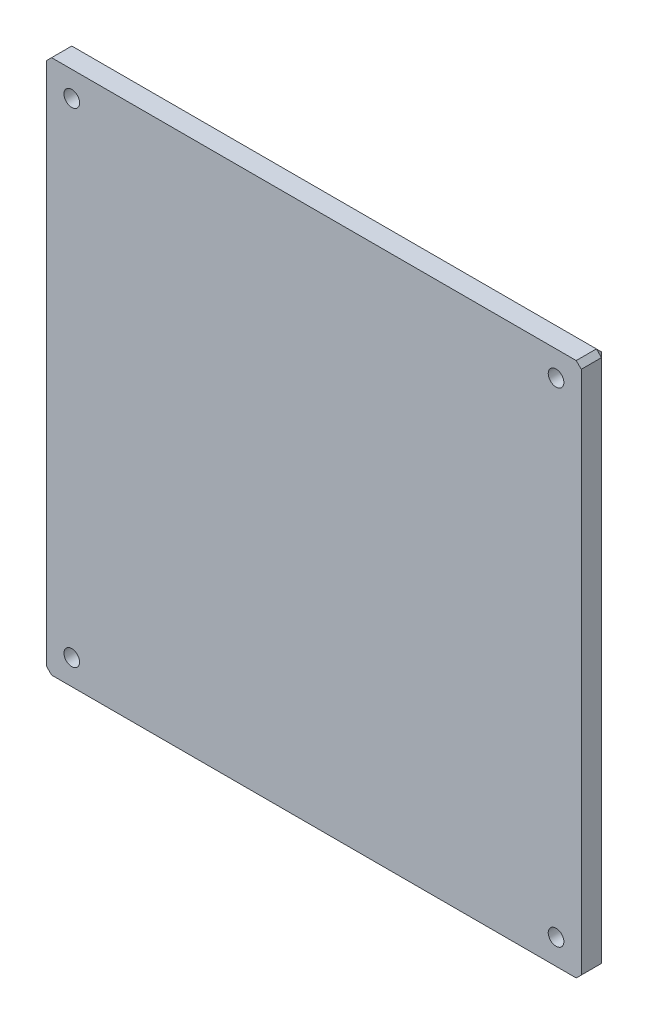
ISO-10303-21;
HEADER;
FILE_DESCRIPTION(('STEP AP214'),'2;1');
FILE_NAME('part.step','',(''),(''),'','','');
FILE_SCHEMA(('AUTOMOTIVE_DESIGN { 1 0 10303 214 1 1 1 1 }'));
ENDSEC;
DATA;
#1=APPLICATION_CONTEXT('core data for automotive mechanical design processes');
#2=APPLICATION_PROTOCOL_DEFINITION('international standard','automotive_design',2000,#1);
#3=PRODUCT_CONTEXT('',#1,'mechanical');
#4=PRODUCT('Part','Part','',(#3));
#5=PRODUCT_RELATED_PRODUCT_CATEGORY('part','',(#4));
#6=PRODUCT_DEFINITION_FORMATION('','',#4);
#7=PRODUCT_DEFINITION_CONTEXT('part definition',#1,'design');
#8=PRODUCT_DEFINITION('design','',#6,#7);
#9=PRODUCT_DEFINITION_SHAPE('','',#8);
#10=(LENGTH_UNIT() NAMED_UNIT(*) SI_UNIT(.MILLI.,.METRE.));
#11=(NAMED_UNIT(*) PLANE_ANGLE_UNIT() SI_UNIT($,.RADIAN.));
#12=(NAMED_UNIT(*) SI_UNIT($,.STERADIAN.) SOLID_ANGLE_UNIT());
#13=UNCERTAINTY_MEASURE_WITH_UNIT(LENGTH_MEASURE(1.E-05),#10,'distance_accuracy_value','');
#14=(GEOMETRIC_REPRESENTATION_CONTEXT(3) GLOBAL_UNCERTAINTY_ASSIGNED_CONTEXT((#13)) GLOBAL_UNIT_ASSIGNED_CONTEXT((#10,
#11,#12)) REPRESENTATION_CONTEXT('',''));
#15=CARTESIAN_POINT('',(0.,0.,0.));
#16=DIRECTION('',(0.,0.,1.));
#17=DIRECTION('',(1.,0.,0.));
#18=AXIS2_PLACEMENT_3D('',#15,#16,#17);
#19=CARTESIAN_POINT('',(-53.,53.,5.));
#20=DIRECTION('',(1.,0.,0.));
#21=DIRECTION('',(0.,0.,-1.));
#22=AXIS2_PLACEMENT_3D('',#19,#20,#21);
#23=PLANE('',#22);
#24=DIRECTION('',(0.,-1.,0.));
#25=VECTOR('',#24,1.);
#26=CARTESIAN_POINT('',(-53.,53.,1.));
#27=LINE('',#26,#25);
#28=CARTESIAN_POINT('',(-53.,52.,1.));
#29=VERTEX_POINT('',#28);
#30=CARTESIAN_POINT('',(-53.,-52.,1.));
#31=VERTEX_POINT('',#30);
#32=EDGE_CURVE('E161',#29,#31,#27,.T.);
#33=ORIENTED_EDGE('',*,*,#32,.T.);
#34=DIRECTION('',(0.,0.,1.));
#35=VECTOR('',#34,1.);
#36=CARTESIAN_POINT('',(-53.,-52.,5.));
#37=LINE('',#36,#35);
#38=CARTESIAN_POINT('',(-53.,-52.,5.));
#39=VERTEX_POINT('',#38);
#40=EDGE_CURVE('E163',#31,#39,#37,.T.);
#41=ORIENTED_EDGE('',*,*,#40,.T.);
#42=DIRECTION('',(0.,-1.,0.));
#43=VECTOR('',#42,1.);
#44=CARTESIAN_POINT('',(-53.,53.,5.));
#45=LINE('',#44,#43);
#46=CARTESIAN_POINT('',(-53.,52.,5.));
#47=VERTEX_POINT('',#46);
#48=EDGE_CURVE('E216',#47,#39,#45,.T.);
#49=ORIENTED_EDGE('',*,*,#48,.F.);
#50=DIRECTION('',(0.,0.,-1.));
#51=VECTOR('',#50,1.);
#52=CARTESIAN_POINT('',(-53.,52.,5.));
#53=LINE('',#52,#51);
#54=EDGE_CURVE('E159',#47,#29,#53,.T.);
#55=ORIENTED_EDGE('',*,*,#54,.T.);
#56=EDGE_LOOP('',(#33,#41,#49,#55));
#57=FACE_BOUND('',#56,.T.);
#58=ADVANCED_FACE('F33',(#57),#23,.F.);
#59=CARTESIAN_POINT('',(-53.,-53.,5.));
#60=DIRECTION('',(0.,1.,0.));
#61=DIRECTION('',(0.,0.,1.));
#62=AXIS2_PLACEMENT_3D('',#59,#60,#61);
#63=PLANE('',#62);
#64=DIRECTION('',(1.,0.,0.));
#65=VECTOR('',#64,1.);
#66=CARTESIAN_POINT('',(-53.,-53.,1.));
#67=LINE('',#66,#65);
#68=CARTESIAN_POINT('',(-52.,-53.,1.));
#69=VERTEX_POINT('',#68);
#70=CARTESIAN_POINT('',(52.,-53.,1.));
#71=VERTEX_POINT('',#70);
#72=EDGE_CURVE('E138',#69,#71,#67,.T.);
#73=ORIENTED_EDGE('',*,*,#72,.T.);
#74=DIRECTION('',(0.,0.,1.));
#75=VECTOR('',#74,1.);
#76=CARTESIAN_POINT('',(52.,-53.,5.));
#77=LINE('',#76,#75);
#78=CARTESIAN_POINT('',(52.,-53.,5.));
#79=VERTEX_POINT('',#78);
#80=EDGE_CURVE('E144',#71,#79,#77,.T.);
#81=ORIENTED_EDGE('',*,*,#80,.T.);
#82=DIRECTION('',(1.,0.,0.));
#83=VECTOR('',#82,1.);
#84=CARTESIAN_POINT('',(-53.,-53.,5.));
#85=LINE('',#84,#83);
#86=CARTESIAN_POINT('',(-52.,-53.,5.));
#87=VERTEX_POINT('',#86);
#88=EDGE_CURVE('E116',#87,#79,#85,.T.);
#89=ORIENTED_EDGE('',*,*,#88,.F.);
#90=DIRECTION('',(0.,0.,-1.));
#91=VECTOR('',#90,1.);
#92=CARTESIAN_POINT('',(-52.,-53.,5.));
#93=LINE('',#92,#91);
#94=EDGE_CURVE('E135',#87,#69,#93,.T.);
#95=ORIENTED_EDGE('',*,*,#94,.T.);
#96=EDGE_LOOP('',(#73,#81,#89,#95));
#97=FACE_BOUND('',#96,.T.);
#98=ADVANCED_FACE('F283',(#97),#63,.F.);
#99=CARTESIAN_POINT('',(53.,53.,5.));
#100=DIRECTION('',(-1.,0.,0.));
#101=DIRECTION('',(0.,0.,1.));
#102=AXIS2_PLACEMENT_3D('',#99,#100,#101);
#103=PLANE('',#102);
#104=DIRECTION('',(0.,1.,0.));
#105=VECTOR('',#104,1.);
#106=CARTESIAN_POINT('',(53.,53.,5.));
#107=LINE('',#106,#105);
#108=CARTESIAN_POINT('',(53.,-52.,5.));
#109=VERTEX_POINT('',#108);
#110=CARTESIAN_POINT('',(53.,52.,5.));
#111=VERTEX_POINT('',#110);
#112=EDGE_CURVE('E113',#109,#111,#107,.T.);
#113=ORIENTED_EDGE('',*,*,#112,.F.);
#114=DIRECTION('',(0.,0.,-1.));
#115=VECTOR('',#114,1.);
#116=CARTESIAN_POINT('',(53.,-52.,5.));
#117=LINE('',#116,#115);
#118=CARTESIAN_POINT('',(53.,-52.,1.));
#119=VERTEX_POINT('',#118);
#120=EDGE_CURVE('E126',#109,#119,#117,.T.);
#121=ORIENTED_EDGE('',*,*,#120,.T.);
#122=DIRECTION('',(0.,1.,0.));
#123=VECTOR('',#122,1.);
#124=CARTESIAN_POINT('',(53.,53.,1.));
#125=LINE('',#124,#123);
#126=CARTESIAN_POINT('',(53.,52.,1.));
#127=VERTEX_POINT('',#126);
#128=EDGE_CURVE('E136',#119,#127,#125,.T.);
#129=ORIENTED_EDGE('',*,*,#128,.T.);
#130=DIRECTION('',(0.,0.,1.));
#131=VECTOR('',#130,1.);
#132=CARTESIAN_POINT('',(53.,52.,5.));
#133=LINE('',#132,#131);
#134=EDGE_CURVE('E128',#127,#111,#133,.T.);
#135=ORIENTED_EDGE('',*,*,#134,.T.);
#136=EDGE_LOOP('',(#113,#121,#129,#135));
#137=FACE_BOUND('',#136,.T.);
#138=ADVANCED_FACE('F125',(#137),#103,.F.);
#139=CARTESIAN_POINT('',(-53.,53.,5.));
#140=DIRECTION('',(0.,-1.,0.));
#141=DIRECTION('',(0.,0.,-1.));
#142=AXIS2_PLACEMENT_3D('',#139,#140,#141);
#143=PLANE('',#142);
#144=DIRECTION('',(-1.,0.,0.));
#145=VECTOR('',#144,1.);
#146=CARTESIAN_POINT('',(-53.,53.,1.));
#147=LINE('',#146,#145);
#148=CARTESIAN_POINT('',(52.,53.,1.));
#149=VERTEX_POINT('',#148);
#150=CARTESIAN_POINT('',(-52.,53.,1.));
#151=VERTEX_POINT('',#150);
#152=EDGE_CURVE('E42',#149,#151,#147,.T.);
#153=ORIENTED_EDGE('',*,*,#152,.T.);
#154=DIRECTION('',(0.,0.,1.));
#155=VECTOR('',#154,1.);
#156=CARTESIAN_POINT('',(-52.,53.,5.));
#157=LINE('',#156,#155);
#158=CARTESIAN_POINT('',(-52.,53.,5.));
#159=VERTEX_POINT('',#158);
#160=EDGE_CURVE('E11',#151,#159,#157,.T.);
#161=ORIENTED_EDGE('',*,*,#160,.T.);
#162=DIRECTION('',(-1.,0.,0.));
#163=VECTOR('',#162,1.);
#164=CARTESIAN_POINT('',(-53.,53.,5.));
#165=LINE('',#164,#163);
#166=CARTESIAN_POINT('',(52.,53.,5.));
#167=VERTEX_POINT('',#166);
#168=EDGE_CURVE('E129',#167,#159,#165,.T.);
#169=ORIENTED_EDGE('',*,*,#168,.F.);
#170=DIRECTION('',(0.,0.,-1.));
#171=VECTOR('',#170,1.);
#172=CARTESIAN_POINT('',(52.,53.,5.));
#173=LINE('',#172,#171);
#174=EDGE_CURVE('E53',#167,#149,#173,.T.);
#175=ORIENTED_EDGE('',*,*,#174,.T.);
#176=EDGE_LOOP('',(#153,#161,#169,#175));
#177=FACE_BOUND('',#176,.T.);
#178=ADVANCED_FACE('F293',(#177),#143,.F.);
#179=CARTESIAN_POINT('',(0.,0.,5.));
#180=DIRECTION('',(0.,0.,1.));
#181=DIRECTION('',(1.,0.,0.));
#182=AXIS2_PLACEMENT_3D('',#179,#180,#181);
#183=PLANE('',#182);
#184=CARTESIAN_POINT('',(48.,48.,5.));
#185=DIRECTION('',(0.,0.,1.));
#186=DIRECTION('',(1.,0.,0.));
#187=AXIS2_PLACEMENT_3D('',#184,#185,#186);
#188=CIRCLE('',#187,1.55);
#189=CARTESIAN_POINT('',(49.55,48.,5.));
#190=VERTEX_POINT('',#189);
#191=EDGE_CURVE('E213',#190,#190,#188,.F.);
#192=ORIENTED_EDGE('',*,*,#191,.T.);
#193=EDGE_LOOP('',(#192));
#194=FACE_BOUND('',#193,.T.);
#195=CARTESIAN_POINT('',(-48.,-48.,5.));
#196=DIRECTION('',(0.,0.,1.));
#197=DIRECTION('',(1.,0.,0.));
#198=AXIS2_PLACEMENT_3D('',#195,#196,#197);
#199=CIRCLE('',#198,1.55);
#200=CARTESIAN_POINT('',(-46.45,-48.,5.));
#201=VERTEX_POINT('',#200);
#202=EDGE_CURVE('E208',#201,#201,#199,.F.);
#203=ORIENTED_EDGE('',*,*,#202,.T.);
#204=EDGE_LOOP('',(#203));
#205=FACE_BOUND('',#204,.T.);
#206=CARTESIAN_POINT('',(48.,-48.,5.));
#207=DIRECTION('',(0.,0.,1.));
#208=DIRECTION('',(1.,0.,0.));
#209=AXIS2_PLACEMENT_3D('',#206,#207,#208);
#210=CIRCLE('',#209,1.55);
#211=CARTESIAN_POINT('',(49.55,-48.,5.));
#212=VERTEX_POINT('',#211);
#213=EDGE_CURVE('E203',#212,#212,#210,.F.);
#214=ORIENTED_EDGE('',*,*,#213,.T.);
#215=EDGE_LOOP('',(#214));
#216=FACE_BOUND('',#215,.T.);
#217=CARTESIAN_POINT('',(-48.,48.,5.));
#218=DIRECTION('',(0.,0.,1.));
#219=DIRECTION('',(1.,0.,0.));
#220=AXIS2_PLACEMENT_3D('',#217,#218,#219);
#221=CIRCLE('',#220,1.55);
#222=CARTESIAN_POINT('',(-46.45,48.,5.));
#223=VERTEX_POINT('',#222);
#224=EDGE_CURVE('E198',#223,#223,#221,.F.);
#225=ORIENTED_EDGE('',*,*,#224,.T.);
#226=EDGE_LOOP('',(#225));
#227=FACE_BOUND('',#226,.T.);
#228=ORIENTED_EDGE('',*,*,#88,.T.);
#229=DIRECTION('',(-0.707106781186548,-0.707106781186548,0.));
#230=VECTOR('',#229,1.);
#231=CARTESIAN_POINT('',(52.5,-52.5,5.));
#232=LINE('',#231,#230);
#233=EDGE_CURVE('E110',#79,#109,#232,.F.);
#234=ORIENTED_EDGE('',*,*,#233,.T.);
#235=ORIENTED_EDGE('',*,*,#112,.T.);
#236=DIRECTION('',(0.707106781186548,-0.707106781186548,0.));
#237=VECTOR('',#236,1.);
#238=CARTESIAN_POINT('',(52.5,52.5,5.));
#239=LINE('',#238,#237);
#240=EDGE_CURVE('E146',#111,#167,#239,.F.);
#241=ORIENTED_EDGE('',*,*,#240,.T.);
#242=ORIENTED_EDGE('',*,*,#168,.T.);
#243=DIRECTION('',(0.707106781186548,0.707106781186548,0.));
#244=VECTOR('',#243,1.);
#245=CARTESIAN_POINT('',(-52.5,52.5,5.));
#246=LINE('',#245,#244);
#247=EDGE_CURVE('E148',#159,#47,#246,.F.);
#248=ORIENTED_EDGE('',*,*,#247,.T.);
#249=ORIENTED_EDGE('',*,*,#48,.T.);
#250=DIRECTION('',(-0.707106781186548,0.707106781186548,0.));
#251=VECTOR('',#250,1.);
#252=CARTESIAN_POINT('',(-52.5,-52.5,5.));
#253=LINE('',#252,#251);
#254=EDGE_CURVE('E121',#39,#87,#253,.F.);
#255=ORIENTED_EDGE('',*,*,#254,.T.);
#256=EDGE_LOOP('',(#228,#234,#235,#241,#242,#248,#249,#255));
#257=FACE_BOUND('',#256,.T.);
#258=ADVANCED_FACE('F112',(#194,#205,#216,#227,#257),#183,.T.);
#259=CARTESIAN_POINT('',(0.,0.,0.));
#260=DIRECTION('',(0.,0.,1.));
#261=DIRECTION('',(1.,0.,0.));
#262=AXIS2_PLACEMENT_3D('',#259,#260,#261);
#263=PLANE('',#262);
#264=DIRECTION('',(0.,-1.,0.));
#265=VECTOR('',#264,1.);
#266=CARTESIAN_POINT('',(52.,0.,0.));
#267=LINE('',#266,#265);
#268=CARTESIAN_POINT('',(52.,52.,0.));
#269=VERTEX_POINT('',#268);
#270=CARTESIAN_POINT('',(52.,-52.,0.));
#271=VERTEX_POINT('',#270);
#272=EDGE_CURVE('E120',#269,#271,#267,.T.);
#273=ORIENTED_EDGE('',*,*,#272,.T.);
#274=DIRECTION('',(-1.,0.,0.));
#275=VECTOR('',#274,1.);
#276=CARTESIAN_POINT('',(0.,-52.,0.));
#277=LINE('',#276,#275);
#278=CARTESIAN_POINT('',(-52.,-52.,0.));
#279=VERTEX_POINT('',#278);
#280=EDGE_CURVE('E156',#271,#279,#277,.T.);
#281=ORIENTED_EDGE('',*,*,#280,.T.);
#282=DIRECTION('',(0.,1.,0.));
#283=VECTOR('',#282,1.);
#284=CARTESIAN_POINT('',(-52.,0.,0.));
#285=LINE('',#284,#283);
#286=CARTESIAN_POINT('',(-52.,52.,0.));
#287=VERTEX_POINT('',#286);
#288=EDGE_CURVE('E154',#279,#287,#285,.T.);
#289=ORIENTED_EDGE('',*,*,#288,.T.);
#290=DIRECTION('',(1.,0.,0.));
#291=VECTOR('',#290,1.);
#292=CARTESIAN_POINT('',(0.,52.,0.));
#293=LINE('',#292,#291);
#294=EDGE_CURVE('E152',#287,#269,#293,.T.);
#295=ORIENTED_EDGE('',*,*,#294,.T.);
#296=EDGE_LOOP('',(#273,#281,#289,#295));
#297=FACE_BOUND('',#296,.T.);
#298=CARTESIAN_POINT('',(-48.,48.,0.));
#299=DIRECTION('',(0.,0.,1.));
#300=DIRECTION('',(1.,0.,0.));
#301=AXIS2_PLACEMENT_3D('',#298,#299,#300);
#302=CIRCLE('',#301,3.55);
#303=CARTESIAN_POINT('',(-44.45,48.,0.));
#304=VERTEX_POINT('',#303);
#305=EDGE_CURVE('E234',#304,#304,#302,.T.);
#306=ORIENTED_EDGE('',*,*,#305,.T.);
#307=EDGE_LOOP('',(#306));
#308=FACE_BOUND('',#307,.T.);
#309=CARTESIAN_POINT('',(-48.,-48.,0.));
#310=DIRECTION('',(0.,0.,1.));
#311=DIRECTION('',(1.,0.,0.));
#312=AXIS2_PLACEMENT_3D('',#309,#310,#311);
#313=CIRCLE('',#312,3.55);
#314=CARTESIAN_POINT('',(-44.45,-48.,0.));
#315=VERTEX_POINT('',#314);
#316=EDGE_CURVE('E231',#315,#315,#313,.T.);
#317=ORIENTED_EDGE('',*,*,#316,.T.);
#318=EDGE_LOOP('',(#317));
#319=FACE_BOUND('',#318,.T.);
#320=CARTESIAN_POINT('',(48.,-48.,0.));
#321=DIRECTION('',(0.,0.,1.));
#322=DIRECTION('',(1.,0.,0.));
#323=AXIS2_PLACEMENT_3D('',#320,#321,#322);
#324=CIRCLE('',#323,3.55);
#325=CARTESIAN_POINT('',(51.55,-48.,0.));
#326=VERTEX_POINT('',#325);
#327=EDGE_CURVE('E228',#326,#326,#324,.T.);
#328=ORIENTED_EDGE('',*,*,#327,.T.);
#329=EDGE_LOOP('',(#328));
#330=FACE_BOUND('',#329,.T.);
#331=CARTESIAN_POINT('',(48.,48.,0.));
#332=DIRECTION('',(0.,0.,1.));
#333=DIRECTION('',(1.,0.,0.));
#334=AXIS2_PLACEMENT_3D('',#331,#332,#333);
#335=CIRCLE('',#334,3.55);
#336=CARTESIAN_POINT('',(51.55,48.,0.));
#337=VERTEX_POINT('',#336);
#338=EDGE_CURVE('E222',#337,#337,#335,.T.);
#339=ORIENTED_EDGE('',*,*,#338,.T.);
#340=EDGE_LOOP('',(#339));
#341=FACE_BOUND('',#340,.T.);
#342=ADVANCED_FACE('F257',(#297,#308,#319,#330,#341),#263,.F.);
#343=CARTESIAN_POINT('',(-48.,48.,10.));
#344=DIRECTION('',(0.,0.,-1.));
#345=DIRECTION('',(-1.,0.,0.));
#346=AXIS2_PLACEMENT_3D('',#343,#344,#345);
#347=CYLINDRICAL_SURFACE('',#346,1.55);
#348=CARTESIAN_POINT('',(-48.,48.,1.99999999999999));
#349=DIRECTION('',(0.,0.,1.));
#350=DIRECTION('',(1.,0.,0.));
#351=AXIS2_PLACEMENT_3D('',#348,#349,#350);
#352=CIRCLE('',#351,1.55);
#353=CARTESIAN_POINT('',(-46.45,48.,1.99999999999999));
#354=VERTEX_POINT('',#353);
#355=EDGE_CURVE('E237',#354,#354,#352,.F.);
#356=ORIENTED_EDGE('',*,*,#355,.T.);
#357=EDGE_LOOP('',(#356));
#358=FACE_BOUND('',#357,.T.);
#359=ORIENTED_EDGE('',*,*,#224,.F.);
#360=EDGE_LOOP('',(#359));
#361=FACE_BOUND('',#360,.T.);
#362=ADVANCED_FACE('F260',(#358,#361),#347,.F.);
#363=CARTESIAN_POINT('',(48.,-48.,10.));
#364=DIRECTION('',(0.,0.,-1.));
#365=DIRECTION('',(-1.,0.,0.));
#366=AXIS2_PLACEMENT_3D('',#363,#364,#365);
#367=CYLINDRICAL_SURFACE('',#366,1.55);
#368=CARTESIAN_POINT('',(48.,-48.,1.99999999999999));
#369=DIRECTION('',(0.,0.,1.));
#370=DIRECTION('',(1.,0.,0.));
#371=AXIS2_PLACEMENT_3D('',#368,#369,#370);
#372=CIRCLE('',#371,1.55);
#373=CARTESIAN_POINT('',(49.55,-48.,1.99999999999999));
#374=VERTEX_POINT('',#373);
#375=EDGE_CURVE('E243',#374,#374,#372,.F.);
#376=ORIENTED_EDGE('',*,*,#375,.T.);
#377=EDGE_LOOP('',(#376));
#378=FACE_BOUND('',#377,.T.);
#379=ORIENTED_EDGE('',*,*,#213,.F.);
#380=EDGE_LOOP('',(#379));
#381=FACE_BOUND('',#380,.T.);
#382=ADVANCED_FACE('F247',(#378,#381),#367,.F.);
#383=CARTESIAN_POINT('',(-48.,-48.,10.));
#384=DIRECTION('',(0.,0.,-1.));
#385=DIRECTION('',(-1.,0.,0.));
#386=AXIS2_PLACEMENT_3D('',#383,#384,#385);
#387=CYLINDRICAL_SURFACE('',#386,1.55);
#388=CARTESIAN_POINT('',(-48.,-48.,1.99999999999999));
#389=DIRECTION('',(0.,0.,1.));
#390=DIRECTION('',(1.,0.,0.));
#391=AXIS2_PLACEMENT_3D('',#388,#389,#390);
#392=CIRCLE('',#391,1.55);
#393=CARTESIAN_POINT('',(-46.45,-48.,1.99999999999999));
#394=VERTEX_POINT('',#393);
#395=EDGE_CURVE('E240',#394,#394,#392,.F.);
#396=ORIENTED_EDGE('',*,*,#395,.T.);
#397=EDGE_LOOP('',(#396));
#398=FACE_BOUND('',#397,.T.);
#399=ORIENTED_EDGE('',*,*,#202,.F.);
#400=EDGE_LOOP('',(#399));
#401=FACE_BOUND('',#400,.T.);
#402=ADVANCED_FACE('F277',(#398,#401),#387,.F.);
#403=CARTESIAN_POINT('',(48.,48.,10.));
#404=DIRECTION('',(0.,0.,-1.));
#405=DIRECTION('',(-1.,0.,0.));
#406=AXIS2_PLACEMENT_3D('',#403,#404,#405);
#407=CYLINDRICAL_SURFACE('',#406,1.55);
#408=CARTESIAN_POINT('',(48.,48.,1.99999999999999));
#409=DIRECTION('',(0.,0.,1.));
#410=DIRECTION('',(1.,0.,0.));
#411=AXIS2_PLACEMENT_3D('',#408,#409,#410);
#412=CIRCLE('',#411,1.55);
#413=CARTESIAN_POINT('',(49.55,48.,1.99999999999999));
#414=VERTEX_POINT('',#413);
#415=EDGE_CURVE('E225',#414,#414,#412,.F.);
#416=ORIENTED_EDGE('',*,*,#415,.T.);
#417=EDGE_LOOP('',(#416));
#418=FACE_BOUND('',#417,.T.);
#419=ORIENTED_EDGE('',*,*,#191,.F.);
#420=EDGE_LOOP('',(#419));
#421=FACE_BOUND('',#420,.T.);
#422=ADVANCED_FACE('F268',(#418,#421),#407,.F.);
#423=CARTESIAN_POINT('',(48.,48.,0.));
#424=DIRECTION('',(0.,0.,-1.));
#425=DIRECTION('',(-1.,0.,0.));
#426=AXIS2_PLACEMENT_3D('',#423,#424,#425);
#427=CONICAL_SURFACE('',#426,3.55,0.78539816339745);
#428=ORIENTED_EDGE('',*,*,#415,.F.);
#429=EDGE_LOOP('',(#428));
#430=FACE_BOUND('',#429,.T.);
#431=ORIENTED_EDGE('',*,*,#338,.F.);
#432=EDGE_LOOP('',(#431));
#433=FACE_BOUND('',#432,.T.);
#434=ADVANCED_FACE('F265',(#430,#433),#427,.F.);
#435=CARTESIAN_POINT('',(-48.,48.,0.));
#436=DIRECTION('',(0.,0.,-1.));
#437=DIRECTION('',(-1.,0.,0.));
#438=AXIS2_PLACEMENT_3D('',#435,#436,#437);
#439=CONICAL_SURFACE('',#438,3.55,0.78539816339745);
#440=ORIENTED_EDGE('',*,*,#355,.F.);
#441=EDGE_LOOP('',(#440));
#442=FACE_BOUND('',#441,.T.);
#443=ORIENTED_EDGE('',*,*,#305,.F.);
#444=EDGE_LOOP('',(#443));
#445=FACE_BOUND('',#444,.T.);
#446=ADVANCED_FACE('F267',(#442,#445),#439,.F.);
#447=CARTESIAN_POINT('',(-48.,-48.,0.));
#448=DIRECTION('',(0.,0.,-1.));
#449=DIRECTION('',(-1.,0.,0.));
#450=AXIS2_PLACEMENT_3D('',#447,#448,#449);
#451=CONICAL_SURFACE('',#450,3.55,0.78539816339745);
#452=ORIENTED_EDGE('',*,*,#395,.F.);
#453=EDGE_LOOP('',(#452));
#454=FACE_BOUND('',#453,.T.);
#455=ORIENTED_EDGE('',*,*,#316,.F.);
#456=EDGE_LOOP('',(#455));
#457=FACE_BOUND('',#456,.T.);
#458=ADVANCED_FACE('F253',(#454,#457),#451,.F.);
#459=CARTESIAN_POINT('',(48.,-48.,0.));
#460=DIRECTION('',(0.,0.,-1.));
#461=DIRECTION('',(-1.,0.,0.));
#462=AXIS2_PLACEMENT_3D('',#459,#460,#461);
#463=CONICAL_SURFACE('',#462,3.55,0.78539816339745);
#464=ORIENTED_EDGE('',*,*,#375,.F.);
#465=EDGE_LOOP('',(#464));
#466=FACE_BOUND('',#465,.T.);
#467=ORIENTED_EDGE('',*,*,#327,.F.);
#468=EDGE_LOOP('',(#467));
#469=FACE_BOUND('',#468,.T.);
#470=ADVANCED_FACE('F250',(#466,#469),#463,.F.);
#471=CARTESIAN_POINT('',(-53.,52.,5.));
#472=DIRECTION('',(0.707106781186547,-0.707106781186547,0.));
#473=DIRECTION('',(0.,0.,-1.));
#474=AXIS2_PLACEMENT_3D('',#471,#472,#473);
#475=PLANE('',#474);
#476=DIRECTION('',(-0.707106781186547,-0.707106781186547,0.));
#477=VECTOR('',#476,1.);
#478=CARTESIAN_POINT('',(-52.5,52.5,1.));
#479=LINE('',#478,#477);
#480=EDGE_CURVE('E37',#29,#151,#479,.F.);
#481=ORIENTED_EDGE('',*,*,#480,.F.);
#482=ORIENTED_EDGE('',*,*,#54,.F.);
#483=ORIENTED_EDGE('',*,*,#247,.F.);
#484=ORIENTED_EDGE('',*,*,#160,.F.);
#485=EDGE_LOOP('',(#481,#482,#483,#484));
#486=FACE_BOUND('',#485,.T.);
#487=ADVANCED_FACE('F35',(#486),#475,.F.);
#488=CARTESIAN_POINT('',(-52.,52.,0.));
#489=DIRECTION('',(-0.577350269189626,0.577350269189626,-0.577350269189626));
#490=DIRECTION('',(-0.707106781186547,0.,0.707106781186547));
#491=AXIS2_PLACEMENT_3D('',#488,#489,#490);
#492=PLANE('',#491);
#493=DIRECTION('',(0.707106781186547,0.,-0.707106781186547));
#494=VECTOR('',#493,1.);
#495=CARTESIAN_POINT('',(-52.,52.,0.));
#496=LINE('',#495,#494);
#497=EDGE_CURVE('E190',#29,#287,#496,.T.);
#498=ORIENTED_EDGE('',*,*,#497,.F.);
#499=ORIENTED_EDGE('',*,*,#480,.T.);
#500=DIRECTION('',(0.,0.707106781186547,0.707106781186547));
#501=VECTOR('',#500,1.);
#502=CARTESIAN_POINT('',(-52.,52.,0.));
#503=LINE('',#502,#501);
#504=EDGE_CURVE('E192',#287,#151,#503,.T.);
#505=ORIENTED_EDGE('',*,*,#504,.F.);
#506=EDGE_LOOP('',(#498,#499,#505));
#507=FACE_BOUND('',#506,.T.);
#508=ADVANCED_FACE('F425',(#507),#492,.T.);
#509=CARTESIAN_POINT('',(52.,53.,5.));
#510=DIRECTION('',(-0.707106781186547,-0.707106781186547,0.));
#511=DIRECTION('',(0.,0.,-1.));
#512=AXIS2_PLACEMENT_3D('',#509,#510,#511);
#513=PLANE('',#512);
#514=ORIENTED_EDGE('',*,*,#240,.F.);
#515=ORIENTED_EDGE('',*,*,#134,.F.);
#516=DIRECTION('',(-0.707106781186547,0.707106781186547,0.));
#517=VECTOR('',#516,1.);
#518=CARTESIAN_POINT('',(52.5,52.5,1.));
#519=LINE('',#518,#517);
#520=EDGE_CURVE('E187',#149,#127,#519,.F.);
#521=ORIENTED_EDGE('',*,*,#520,.F.);
#522=ORIENTED_EDGE('',*,*,#174,.F.);
#523=EDGE_LOOP('',(#514,#515,#521,#522));
#524=FACE_BOUND('',#523,.T.);
#525=ADVANCED_FACE('F423',(#524),#513,.F.);
#526=CARTESIAN_POINT('',(-53.,53.,1.));
#527=DIRECTION('',(0.,-0.707106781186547,0.707106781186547));
#528=DIRECTION('',(-1.,0.,0.));
#529=AXIS2_PLACEMENT_3D('',#526,#527,#528);
#530=PLANE('',#529);
#531=ORIENTED_EDGE('',*,*,#504,.T.);
#532=ORIENTED_EDGE('',*,*,#152,.F.);
#533=DIRECTION('',(0.,-0.707106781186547,-0.707106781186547));
#534=VECTOR('',#533,1.);
#535=CARTESIAN_POINT('',(52.,52.,0.));
#536=LINE('',#535,#534);
#537=EDGE_CURVE('E184',#269,#149,#536,.F.);
#538=ORIENTED_EDGE('',*,*,#537,.F.);
#539=ORIENTED_EDGE('',*,*,#294,.F.);
#540=EDGE_LOOP('',(#531,#532,#538,#539));
#541=FACE_BOUND('',#540,.T.);
#542=ADVANCED_FACE('F419',(#541),#530,.F.);
#543=CARTESIAN_POINT('',(-53.,53.,1.));
#544=DIRECTION('',(0.707106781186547,0.,0.707106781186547));
#545=DIRECTION('',(0.,-1.,0.));
#546=AXIS2_PLACEMENT_3D('',#543,#544,#545);
#547=PLANE('',#546);
#548=ORIENTED_EDGE('',*,*,#497,.T.);
#549=ORIENTED_EDGE('',*,*,#288,.F.);
#550=DIRECTION('',(-0.707106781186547,0.,0.707106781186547));
#551=VECTOR('',#550,1.);
#552=CARTESIAN_POINT('',(-52.,-52.,0.));
#553=LINE('',#552,#551);
#554=EDGE_CURVE('E181',#31,#279,#553,.F.);
#555=ORIENTED_EDGE('',*,*,#554,.F.);
#556=ORIENTED_EDGE('',*,*,#32,.F.);
#557=EDGE_LOOP('',(#548,#549,#555,#556));
#558=FACE_BOUND('',#557,.T.);
#559=ADVANCED_FACE('F415',(#558),#547,.F.);
#560=CARTESIAN_POINT('',(-52.,-53.,5.));
#561=DIRECTION('',(0.707106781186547,0.707106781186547,0.));
#562=DIRECTION('',(0.,0.,-1.));
#563=AXIS2_PLACEMENT_3D('',#560,#561,#562);
#564=PLANE('',#563);
#565=ORIENTED_EDGE('',*,*,#254,.F.);
#566=ORIENTED_EDGE('',*,*,#40,.F.);
#567=DIRECTION('',(0.707106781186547,-0.707106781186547,0.));
#568=VECTOR('',#567,1.);
#569=CARTESIAN_POINT('',(-52.5,-52.5,1.));
#570=LINE('',#569,#568);
#571=EDGE_CURVE('E178',#69,#31,#570,.F.);
#572=ORIENTED_EDGE('',*,*,#571,.F.);
#573=ORIENTED_EDGE('',*,*,#94,.F.);
#574=EDGE_LOOP('',(#565,#566,#572,#573));
#575=FACE_BOUND('',#574,.T.);
#576=ADVANCED_FACE('F411',(#575),#564,.F.);
#577=CARTESIAN_POINT('',(52.,52.,0.));
#578=DIRECTION('',(0.577350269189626,0.577350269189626,-0.577350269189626));
#579=DIRECTION('',(-0.707106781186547,0.,-0.707106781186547));
#580=AXIS2_PLACEMENT_3D('',#577,#578,#579);
#581=PLANE('',#580);
#582=ORIENTED_EDGE('',*,*,#537,.T.);
#583=ORIENTED_EDGE('',*,*,#520,.T.);
#584=DIRECTION('',(0.707106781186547,0.,0.707106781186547));
#585=VECTOR('',#584,1.);
#586=CARTESIAN_POINT('',(52.,52.,0.));
#587=LINE('',#586,#585);
#588=EDGE_CURVE('E175',#269,#127,#587,.T.);
#589=ORIENTED_EDGE('',*,*,#588,.F.);
#590=EDGE_LOOP('',(#582,#583,#589));
#591=FACE_BOUND('',#590,.T.);
#592=ADVANCED_FACE('F407',(#591),#581,.T.);
#593=CARTESIAN_POINT('',(-52.,-52.,0.));
#594=DIRECTION('',(-0.577350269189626,-0.577350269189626,-0.577350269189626));
#595=DIRECTION('',(-0.707106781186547,0.,0.707106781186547));
#596=AXIS2_PLACEMENT_3D('',#593,#594,#595);
#597=PLANE('',#596);
#598=ORIENTED_EDGE('',*,*,#571,.T.);
#599=ORIENTED_EDGE('',*,*,#554,.T.);
#600=DIRECTION('',(0.,0.707106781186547,-0.707106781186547));
#601=VECTOR('',#600,1.);
#602=CARTESIAN_POINT('',(-52.,-52.,0.));
#603=LINE('',#602,#601);
#604=EDGE_CURVE('E173',#69,#279,#603,.T.);
#605=ORIENTED_EDGE('',*,*,#604,.F.);
#606=EDGE_LOOP('',(#598,#599,#605));
#607=FACE_BOUND('',#606,.T.);
#608=ADVANCED_FACE('F403',(#607),#597,.T.);
#609=CARTESIAN_POINT('',(53.,53.,1.));
#610=DIRECTION('',(-0.707106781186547,0.,0.707106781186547));
#611=DIRECTION('',(0.,1.,0.));
#612=AXIS2_PLACEMENT_3D('',#609,#610,#611);
#613=PLANE('',#612);
#614=ORIENTED_EDGE('',*,*,#588,.T.);
#615=ORIENTED_EDGE('',*,*,#128,.F.);
#616=DIRECTION('',(-0.707106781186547,0.,-0.707106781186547));
#617=VECTOR('',#616,1.);
#618=CARTESIAN_POINT('',(53.,-52.,1.));
#619=LINE('',#618,#617);
#620=EDGE_CURVE('E171',#271,#119,#619,.F.);
#621=ORIENTED_EDGE('',*,*,#620,.F.);
#622=ORIENTED_EDGE('',*,*,#272,.F.);
#623=EDGE_LOOP('',(#614,#615,#621,#622));
#624=FACE_BOUND('',#623,.T.);
#625=ADVANCED_FACE('F399',(#624),#613,.F.);
#626=CARTESIAN_POINT('',(-53.,-53.,1.));
#627=DIRECTION('',(0.,0.707106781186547,0.707106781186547));
#628=DIRECTION('',(1.,0.,0.));
#629=AXIS2_PLACEMENT_3D('',#626,#627,#628);
#630=PLANE('',#629);
#631=ORIENTED_EDGE('',*,*,#604,.T.);
#632=ORIENTED_EDGE('',*,*,#280,.F.);
#633=DIRECTION('',(0.,-0.707106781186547,0.707106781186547));
#634=VECTOR('',#633,1.);
#635=CARTESIAN_POINT('',(52.,-52.5,0.5));
#636=LINE('',#635,#634);
#637=EDGE_CURVE('E168',#71,#271,#636,.F.);
#638=ORIENTED_EDGE('',*,*,#637,.F.);
#639=ORIENTED_EDGE('',*,*,#72,.F.);
#640=EDGE_LOOP('',(#631,#632,#638,#639));
#641=FACE_BOUND('',#640,.T.);
#642=ADVANCED_FACE('F395',(#641),#630,.F.);
#643=CARTESIAN_POINT('',(53.,-52.,1.));
#644=DIRECTION('',(0.577350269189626,-0.577350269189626,-0.577350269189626));
#645=DIRECTION('',(-0.707106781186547,0.,-0.707106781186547));
#646=AXIS2_PLACEMENT_3D('',#643,#644,#645);
#647=PLANE('',#646);
#648=ORIENTED_EDGE('',*,*,#637,.T.);
#649=ORIENTED_EDGE('',*,*,#620,.T.);
#650=DIRECTION('',(0.707106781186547,0.707106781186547,0.));
#651=VECTOR('',#650,1.);
#652=CARTESIAN_POINT('',(53.,-52.,1.));
#653=LINE('',#652,#651);
#654=EDGE_CURVE('E133',#71,#119,#653,.T.);
#655=ORIENTED_EDGE('',*,*,#654,.F.);
#656=EDGE_LOOP('',(#648,#649,#655));
#657=FACE_BOUND('',#656,.T.);
#658=ADVANCED_FACE('F392',(#657),#647,.T.);
#659=CARTESIAN_POINT('',(53.,-52.,5.));
#660=DIRECTION('',(-0.707106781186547,0.707106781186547,0.));
#661=DIRECTION('',(0.,0.,-1.));
#662=AXIS2_PLACEMENT_3D('',#659,#660,#661);
#663=PLANE('',#662);
#664=ORIENTED_EDGE('',*,*,#233,.F.);
#665=ORIENTED_EDGE('',*,*,#80,.F.);
#666=ORIENTED_EDGE('',*,*,#654,.T.);
#667=ORIENTED_EDGE('',*,*,#120,.F.);
#668=EDGE_LOOP('',(#664,#665,#666,#667));
#669=FACE_BOUND('',#668,.T.);
#670=ADVANCED_FACE('F131',(#669),#663,.F.);
#671=CLOSED_SHELL('',(#58,#98,#138,#178,#258,#342,#362,#382,#402,#422,#434,#446,#458,#470,#487,
#508,#525,#542,#559,#576,#592,#608,#625,#642,#658,#670));
#672=MANIFOLD_SOLID_BREP('B2',#671);
#673=ADVANCED_BREP_SHAPE_REPRESENTATION('',(#18,#672),#14);
#674=SHAPE_DEFINITION_REPRESENTATION(#9,#673);
ENDSEC;
END-ISO-10303-21;
